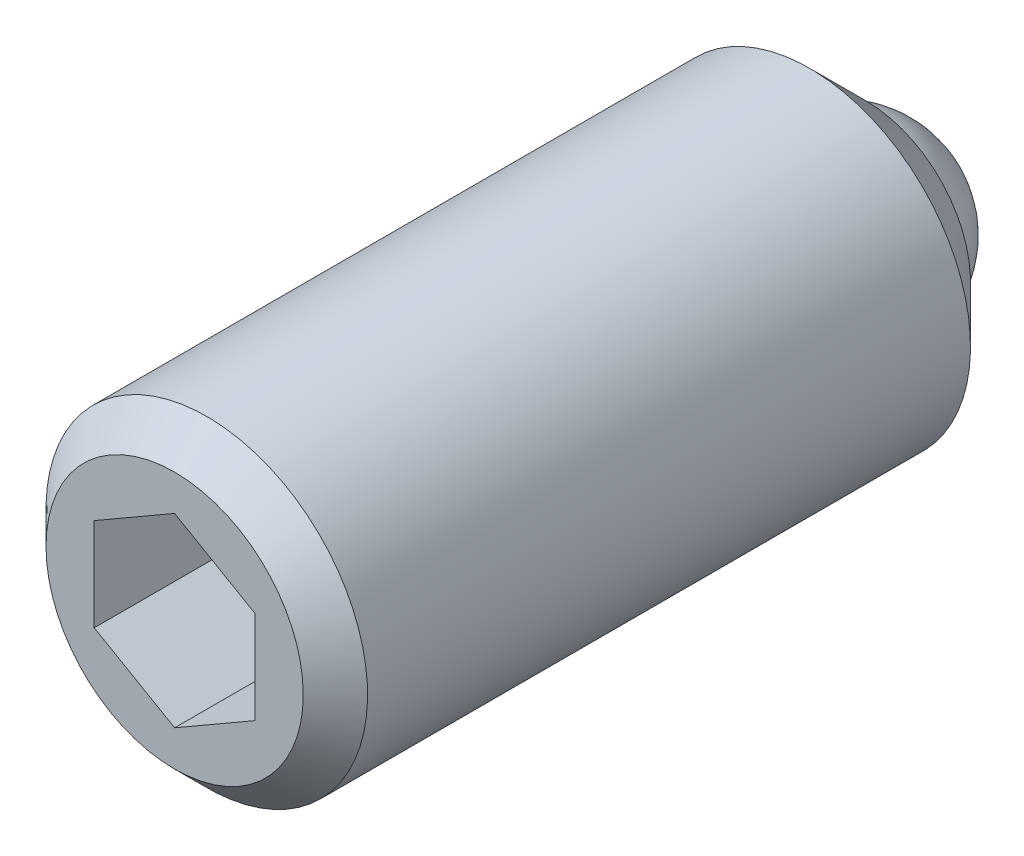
ISO-10303-21;
HEADER;
FILE_DESCRIPTION(('STEP AP214'),'2;1');
FILE_NAME('part.step','',(''),(''),'','','');
FILE_SCHEMA(('AUTOMOTIVE_DESIGN { 1 0 10303 214 1 1 1 1 }'));
ENDSEC;
DATA;
#1=APPLICATION_CONTEXT('core data for automotive mechanical design processes');
#2=APPLICATION_PROTOCOL_DEFINITION('international standard','automotive_design',2000,#1);
#3=PRODUCT_CONTEXT('',#1,'mechanical');
#4=PRODUCT('Part','Part','',(#3));
#5=PRODUCT_RELATED_PRODUCT_CATEGORY('part','',(#4));
#6=PRODUCT_DEFINITION_FORMATION('','',#4);
#7=PRODUCT_DEFINITION_CONTEXT('part definition',#1,'design');
#8=PRODUCT_DEFINITION('design','',#6,#7);
#9=PRODUCT_DEFINITION_SHAPE('','',#8);
#10=(LENGTH_UNIT() NAMED_UNIT(*) SI_UNIT(.MILLI.,.METRE.));
#11=(NAMED_UNIT(*) PLANE_ANGLE_UNIT() SI_UNIT($,.RADIAN.));
#12=(NAMED_UNIT(*) SI_UNIT($,.STERADIAN.) SOLID_ANGLE_UNIT());
#13=UNCERTAINTY_MEASURE_WITH_UNIT(LENGTH_MEASURE(1.E-05),#10,'distance_accuracy_value','');
#14=(GEOMETRIC_REPRESENTATION_CONTEXT(3) GLOBAL_UNCERTAINTY_ASSIGNED_CONTEXT((#13)) GLOBAL_UNIT_ASSIGNED_CONTEXT((#10,
#11,#12)) REPRESENTATION_CONTEXT('',''));
#15=CARTESIAN_POINT('',(0.,0.,0.));
#16=DIRECTION('',(0.,0.,1.));
#17=DIRECTION('',(1.,0.,0.));
#18=AXIS2_PLACEMENT_3D('',#15,#16,#17);
#19=CARTESIAN_POINT('',(-5.03895148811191E-08,-3.00000797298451E-08,6.));
#20=DIRECTION('',(2.62001557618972E-10,0.,1.));
#21=DIRECTION('',(-0.866025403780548,-0.500000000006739,2.26893360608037E-10));
#22=AXIS2_PLACEMENT_3D('',#19,#20,#21);
#23=SPHERICAL_SURFACE('',#22,6.);
#24=CARTESIAN_POINT('',(0.,0.,0.));
#25=VERTEX_POINT('',#24);
#26=VERTEX_LOOP('',#25);
#27=FACE_BOUND('',#26,.T.);
#28=CARTESIAN_POINT('',(-5.07825172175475E-08,-3.00000597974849E-08,4.5));
#29=DIRECTION('',(2.62001557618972E-10,0.,1.));
#30=DIRECTION('',(-0.500000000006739,0.866025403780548,1.31012286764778E-10));
#31=AXIS2_PLACEMENT_3D('',#28,#29,#30);
#32=CIRCLE('',#31,5.80947501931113);
#33=CARTESIAN_POINT('',(-2.90473756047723,5.03115291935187,4.50000000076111));
#34=VERTEX_POINT('',#33);
#35=EDGE_CURVE('E18',#34,#34,#32,.F.);
#36=ORIENTED_EDGE('',*,*,#35,.T.);
#37=EDGE_LOOP('',(#36));
#38=FACE_BOUND('',#37,.T.);
#39=ADVANCED_FACE('F14',(#27,#38),#23,.T.);
#40=CARTESIAN_POINT('',(2.55999995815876,7.25151935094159,39.4999999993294));
#41=DIRECTION('',(-2.62001557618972E-10,0.,-1.));
#42=DIRECTION('',(0.500000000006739,-0.866025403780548,-1.31012286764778E-10));
#43=AXIS2_PLACEMENT_3D('',#40,#41,#42);
#44=PLANE('',#43);
#45=DIRECTION('',(0.866025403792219,-0.499999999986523,-2.26906648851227E-10));
#46=VECTOR('',#45,1.);
#47=CARTESIAN_POINT('',(-2.50000004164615,-4.33012704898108,39.5000000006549));
#48=LINE('',#47,#46);
#49=CARTESIAN_POINT('',(-5.00000003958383,-2.88675137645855,39.50000000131));
#50=VERTEX_POINT('',#49);
#51=CARTESIAN_POINT('',(-4.09274229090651E-08,-5.77350272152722,39.5));
#52=VERTEX_POINT('',#51);
#53=EDGE_CURVE('E83',#50,#52,#48,.T.);
#54=ORIENTED_EDGE('',*,*,#53,.T.);
#55=DIRECTION('',(0.866025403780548,0.500000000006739,-2.26893360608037E-10));
#56=VECTOR('',#55,1.);
#57=CARTESIAN_POINT('',(2.49999995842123,-4.33012704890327,39.499999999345));
#58=LINE('',#57,#56);
#59=CARTESIAN_POINT('',(4.9999999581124,-2.88675137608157,39.49999999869));
#60=VERTEX_POINT('',#59);
#61=EDGE_CURVE('E77',#52,#60,#58,.T.);
#62=ORIENTED_EDGE('',*,*,#61,.T.);
#63=DIRECTION('',(0.,1.,0.));
#64=VECTOR('',#63,1.);
#65=CARTESIAN_POINT('',(4.99999995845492,-2.99227179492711E-08,39.49999999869));
#66=LINE('',#65,#64);
#67=CARTESIAN_POINT('',(4.99999995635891,2.8867513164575,39.4999999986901));
#68=VERTEX_POINT('',#67);
#69=EDGE_CURVE('E80',#60,#68,#66,.T.);
#70=ORIENTED_EDGE('',*,*,#69,.T.);
#71=DIRECTION('',(-0.866025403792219,0.499999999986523,2.26906648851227E-10));
#72=VECTOR('',#71,1.);
#73=CARTESIAN_POINT('',(2.49999995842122,4.33012698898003,39.4999999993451));
#74=LINE('',#73,#72);
#75=CARTESIAN_POINT('',(-4.19549837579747E-08,5.77350266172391,39.5));
#76=VERTEX_POINT('',#75);
#77=EDGE_CURVE('E95',#68,#76,#74,.T.);
#78=ORIENTED_EDGE('',*,*,#77,.T.);
#79=DIRECTION('',(-0.866025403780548,-0.500000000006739,2.26893360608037E-10));
#80=VECTOR('',#79,1.);
#81=CARTESIAN_POINT('',(-2.50000004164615,4.33012698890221,39.500000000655));
#82=LINE('',#81,#80);
#83=CARTESIAN_POINT('',(-5.00000004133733,2.88675131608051,39.50000000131));
#84=VERTEX_POINT('',#83);
#85=EDGE_CURVE('E101',#76,#84,#82,.T.);
#86=ORIENTED_EDGE('',*,*,#85,.T.);
#87=DIRECTION('',(0.,-1.,0.));
#88=VECTOR('',#87,1.);
#89=CARTESIAN_POINT('',(-5.00000004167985,-3.00783330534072E-08,39.50000000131));
#90=LINE('',#89,#88);
#91=EDGE_CURVE('E104',#84,#50,#90,.T.);
#92=ORIENTED_EDGE('',*,*,#91,.T.);
#93=EDGE_LOOP('',(#54,#62,#70,#78,#86,#92));
#94=FACE_BOUND('',#93,.T.);
#95=ADVANCED_FACE('F78',(#94),#44,.F.);
#96=CARTESIAN_POINT('',(9.00531727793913,-2.39639778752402,4.49999999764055));
#97=DIRECTION('',(2.62001557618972E-10,0.,1.));
#98=DIRECTION('',(-0.500000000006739,0.866025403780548,1.31012286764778E-10));
#99=AXIS2_PLACEMENT_3D('',#96,#97,#98);
#100=PLANE('',#99);
#101=ORIENTED_EDGE('',*,*,#35,.F.);
#102=EDGE_LOOP('',(#101));
#103=FACE_BOUND('',#102,.T.);
#104=CARTESIAN_POINT('',(-5.07825172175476E-08,-3.00000597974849E-08,4.5));
#105=DIRECTION('',(2.62002019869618E-10,0.,1.));
#106=DIRECTION('',(-0.866025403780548,-0.500000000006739,2.26893894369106E-10));
#107=AXIS2_PLACEMENT_3D('',#104,#105,#106);
#108=CIRCLE('',#107,6.5);
#109=CARTESIAN_POINT('',(-5.62916517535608,-3.25000003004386,4.50000000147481));
#110=VERTEX_POINT('',#109);
#111=EDGE_CURVE('E121',#110,#110,#108,.T.);
#112=ORIENTED_EDGE('',*,*,#111,.F.);
#113=EDGE_LOOP('',(#112));
#114=FACE_BOUND('',#113,.T.);
#115=ADVANCED_FACE('F134',(#103,#114),#100,.F.);
#116=CARTESIAN_POINT('',(4.99999996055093,-2.88675137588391,47.49999999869));
#117=DIRECTION('',(0.500000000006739,-0.866025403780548,-1.31012286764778E-10));
#118=DIRECTION('',(-0.866025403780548,-0.500000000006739,2.26893360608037E-10));
#119=AXIS2_PLACEMENT_3D('',#116,#117,#118);
#120=PLANE('',#119);
#121=DIRECTION('',(-2.62001557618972E-10,0.,-1.));
#122=VECTOR('',#121,1.);
#123=CARTESIAN_POINT('',(4.99999995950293,-2.88675137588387,43.49999999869));
#124=LINE('',#123,#122);
#125=CARTESIAN_POINT('',(4.99999996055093,-2.88675137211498,47.49999999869));
#126=VERTEX_POINT('',#125);
#127=EDGE_CURVE('E84',#126,#60,#124,.T.);
#128=ORIENTED_EDGE('',*,*,#127,.T.);
#129=ORIENTED_EDGE('',*,*,#61,.F.);
#130=DIRECTION('',(2.62001557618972E-10,0.,1.));
#131=VECTOR('',#130,1.);
#132=CARTESIAN_POINT('',(-4.05644541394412E-08,-5.77350272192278,43.5));
#133=LINE('',#132,#131);
#134=CARTESIAN_POINT('',(-4.27804501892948E-08,-5.77350272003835,47.5));
#135=VERTEX_POINT('',#134);
#136=EDGE_CURVE('E54',#52,#135,#133,.T.);
#137=ORIENTED_EDGE('',*,*,#136,.T.);
#138=DIRECTION('',(0.866025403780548,0.500000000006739,-2.26893360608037E-10));
#139=VECTOR('',#138,1.);
#140=CARTESIAN_POINT('',(2.49999995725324,-4.33012704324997,47.4999999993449));
#141=LINE('',#140,#139);
#142=EDGE_CURVE('E48',#135,#126,#141,.T.);
#143=ORIENTED_EDGE('',*,*,#142,.T.);
#144=EDGE_LOOP('',(#128,#129,#137,#143));
#145=FACE_BOUND('',#144,.T.);
#146=ADVANCED_FACE('F86',(#145),#120,.F.);
#147=CARTESIAN_POINT('',(4.99999996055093,2.88675131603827,47.49999999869));
#148=DIRECTION('',(1.,0.,-2.62001557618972E-10));
#149=DIRECTION('',(0.,-1.,0.));
#150=AXIS2_PLACEMENT_3D('',#147,#148,#149);
#151=PLANE('',#150);
#152=DIRECTION('',(-2.62001557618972E-10,0.,-1.));
#153=VECTOR('',#152,1.);
#154=CARTESIAN_POINT('',(4.99999995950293,2.88675131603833,43.4999999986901));
#155=LINE('',#154,#153);
#156=CARTESIAN_POINT('',(4.99999996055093,2.88675131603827,47.49999999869));
#157=VERTEX_POINT('',#156);
#158=EDGE_CURVE('E92',#157,#68,#155,.T.);
#159=ORIENTED_EDGE('',*,*,#158,.T.);
#160=ORIENTED_EDGE('',*,*,#69,.F.);
#161=ORIENTED_EDGE('',*,*,#127,.F.);
#162=DIRECTION('',(0.,-1.,0.));
#163=VECTOR('',#162,1.);
#164=CARTESIAN_POINT('',(4.99999996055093,2.88675131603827,47.49999999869));
#165=LINE('',#164,#163);
#166=EDGE_CURVE('E120',#126,#157,#165,.F.);
#167=ORIENTED_EDGE('',*,*,#166,.T.);
#168=EDGE_LOOP('',(#159,#160,#161,#167));
#169=FACE_BOUND('',#168,.T.);
#170=ADVANCED_FACE('F90',(#169),#151,.F.);
#171=CARTESIAN_POINT('',(-3.95164521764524E-08,5.77350266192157,47.5));
#172=DIRECTION('',(0.499999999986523,0.866025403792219,-1.30989270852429E-10));
#173=DIRECTION('',(0.866025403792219,-0.499999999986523,-2.26906648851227E-10));
#174=AXIS2_PLACEMENT_3D('',#171,#172,#173);
#175=PLANE('',#174);
#176=DIRECTION('',(-2.62001557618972E-10,0.,-1.));
#177=VECTOR('',#176,1.);
#178=CARTESIAN_POINT('',(-4.05644593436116E-08,5.77350266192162,43.5));
#179=LINE('',#178,#177);
#180=CARTESIAN_POINT('',(-3.62524532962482E-08,5.77350266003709,47.5));
#181=VERTEX_POINT('',#180);
#182=EDGE_CURVE('E100',#181,#76,#179,.T.);
#183=ORIENTED_EDGE('',*,*,#182,.T.);
#184=ORIENTED_EDGE('',*,*,#77,.F.);
#185=ORIENTED_EDGE('',*,*,#158,.F.);
#186=DIRECTION('',(0.866025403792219,-0.499999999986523,-2.26906648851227E-10));
#187=VECTOR('',#186,1.);
#188=CARTESIAN_POINT('',(-3.95164521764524E-08,5.77350266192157,47.5));
#189=LINE('',#188,#187);
#190=EDGE_CURVE('E114',#157,#181,#189,.F.);
#191=ORIENTED_EDGE('',*,*,#190,.T.);
#192=EDGE_LOOP('',(#183,#184,#185,#191));
#193=FACE_BOUND('',#192,.T.);
#194=ADVANCED_FACE('F200',(#193),#175,.F.);
#195=CARTESIAN_POINT('',(-5.00000003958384,2.88675131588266,47.5000000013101));
#196=DIRECTION('',(-0.500000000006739,0.866025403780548,1.31012286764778E-10));
#197=DIRECTION('',(0.866025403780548,0.500000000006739,-2.26893360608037E-10));
#198=AXIS2_PLACEMENT_3D('',#195,#196,#197);
#199=PLANE('',#198);
#200=DIRECTION('',(-2.62001557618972E-10,0.,-1.));
#201=VECTOR('',#200,1.);
#202=CARTESIAN_POINT('',(-5.00000004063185,2.88675131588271,43.50000000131));
#203=LINE('',#202,#201);
#204=CARTESIAN_POINT('',(-5.00000003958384,2.88675131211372,47.5000000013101));
#205=VERTEX_POINT('',#204);
#206=EDGE_CURVE('E103',#205,#84,#203,.T.);
#207=ORIENTED_EDGE('',*,*,#206,.T.);
#208=ORIENTED_EDGE('',*,*,#85,.F.);
#209=ORIENTED_EDGE('',*,*,#182,.F.);
#210=DIRECTION('',(-0.866025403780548,-0.500000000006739,2.26893360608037E-10));
#211=VECTOR('',#210,1.);
#212=CARTESIAN_POINT('',(-2.50000003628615,4.3301269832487,47.5000000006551));
#213=LINE('',#212,#211);
#214=EDGE_CURVE('E112',#181,#205,#213,.T.);
#215=ORIENTED_EDGE('',*,*,#214,.T.);
#216=EDGE_LOOP('',(#207,#208,#209,#215));
#217=FACE_BOUND('',#216,.T.);
#218=ADVANCED_FACE('F209',(#217),#199,.F.);
#219=CARTESIAN_POINT('',(-5.00000003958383,-2.88675137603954,47.50000000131));
#220=DIRECTION('',(-1.,0.,2.62001557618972E-10));
#221=DIRECTION('',(0.,1.,0.));
#222=AXIS2_PLACEMENT_3D('',#219,#220,#221);
#223=PLANE('',#222);
#224=DIRECTION('',(-2.62001557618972E-10,0.,-1.));
#225=VECTOR('',#224,1.);
#226=CARTESIAN_POINT('',(-5.00000004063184,-2.88675137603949,43.5000000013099));
#227=LINE('',#226,#225);
#228=CARTESIAN_POINT('',(-5.00000003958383,-2.88675137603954,47.50000000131));
#229=VERTEX_POINT('',#228);
#230=EDGE_CURVE('E106',#229,#50,#227,.T.);
#231=ORIENTED_EDGE('',*,*,#230,.T.);
#232=ORIENTED_EDGE('',*,*,#91,.F.);
#233=ORIENTED_EDGE('',*,*,#206,.F.);
#234=DIRECTION('',(0.,1.,0.));
#235=VECTOR('',#234,1.);
#236=CARTESIAN_POINT('',(-5.00000003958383,-2.88675137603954,47.50000000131));
#237=LINE('',#236,#235);
#238=EDGE_CURVE('E33',#205,#229,#237,.F.);
#239=ORIENTED_EDGE('',*,*,#238,.T.);
#240=EDGE_LOOP('',(#231,#232,#233,#239));
#241=FACE_BOUND('',#240,.T.);
#242=ADVANCED_FACE('F219',(#241),#223,.F.);
#243=CARTESIAN_POINT('',(-3.95164517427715E-08,-5.77350272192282,47.5));
#244=DIRECTION('',(-0.499999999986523,-0.866025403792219,1.30989270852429E-10));
#245=DIRECTION('',(-0.866025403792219,0.499999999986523,2.26906648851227E-10));
#246=AXIS2_PLACEMENT_3D('',#243,#244,#245);
#247=PLANE('',#246);
#248=ORIENTED_EDGE('',*,*,#136,.F.);
#249=ORIENTED_EDGE('',*,*,#53,.F.);
#250=ORIENTED_EDGE('',*,*,#230,.F.);
#251=DIRECTION('',(-0.866025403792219,0.499999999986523,2.26906648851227E-10));
#252=VECTOR('',#251,1.);
#253=CARTESIAN_POINT('',(-3.95164517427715E-08,-5.77350272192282,47.5));
#254=LINE('',#253,#252);
#255=EDGE_CURVE('E110',#229,#135,#254,.F.);
#256=ORIENTED_EDGE('',*,*,#255,.T.);
#257=EDGE_LOOP('',(#248,#249,#250,#256));
#258=FACE_BOUND('',#257,.T.);
#259=ADVANCED_FACE('F160',(#258),#247,.F.);
#260=CARTESIAN_POINT('',(-5.07825172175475E-08,-3.00000597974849E-08,4.5));
#261=DIRECTION('',(2.62002019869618E-10,0.,1.));
#262=DIRECTION('',(-0.866025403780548,-0.500000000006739,2.26893894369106E-10));
#263=AXIS2_PLACEMENT_3D('',#260,#261,#262);
#264=CONICAL_SURFACE('',#263,6.5,0.785398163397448);
#265=CARTESIAN_POINT('',(-4.98655117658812E-08,-3.00001063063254E-08,8.));
#266=DIRECTION('',(2.62001557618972E-10,0.,1.));
#267=DIRECTION('',(-0.500000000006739,0.866025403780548,1.31012286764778E-10));
#268=AXIS2_PLACEMENT_3D('',#265,#266,#267);
#269=CIRCLE('',#268,10.);
#270=CARTESIAN_POINT('',(-5.0000000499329,8.66025400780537,8.00000000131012));
#271=VERTEX_POINT('',#270);
#272=EDGE_CURVE('E108',#271,#271,#269,.T.);
#273=ORIENTED_EDGE('',*,*,#272,.F.);
#274=EDGE_LOOP('',(#273));
#275=FACE_BOUND('',#274,.T.);
#276=ORIENTED_EDGE('',*,*,#111,.T.);
#277=EDGE_LOOP('',(#276));
#278=FACE_BOUND('',#277,.T.);
#279=ADVANCED_FACE('F132',(#275,#278),#264,.T.);
#280=CARTESIAN_POINT('',(2.98746744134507,11.0732706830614,47.4999999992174));
#281=DIRECTION('',(-2.62001557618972E-10,0.,-1.));
#282=DIRECTION('',(0.500000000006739,-0.866025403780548,-1.31012286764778E-10));
#283=AXIS2_PLACEMENT_3D('',#280,#281,#282);
#284=PLANE('',#283);
#285=ORIENTED_EDGE('',*,*,#238,.F.);
#286=ORIENTED_EDGE('',*,*,#214,.F.);
#287=ORIENTED_EDGE('',*,*,#190,.F.);
#288=ORIENTED_EDGE('',*,*,#166,.F.);
#289=ORIENTED_EDGE('',*,*,#142,.F.);
#290=ORIENTED_EDGE('',*,*,#255,.F.);
#291=EDGE_LOOP('',(#285,#286,#287,#288,#289,#290));
#292=FACE_BOUND('',#291,.T.);
#293=CARTESIAN_POINT('',(-3.95164502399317E-08,-3.00006311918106E-08,47.5));
#294=DIRECTION('',(-2.62001557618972E-10,0.,-1.));
#295=DIRECTION('',(0.500000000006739,-0.866025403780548,-1.31012286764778E-10));
#296=AXIS2_PLACEMENT_3D('',#293,#294,#295);
#297=CIRCLE('',#296,8.);
#298=CARTESIAN_POINT('',(3.99999996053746,-6.92820326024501,47.4999999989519));
#299=VERTEX_POINT('',#298);
#300=EDGE_CURVE('E24',#299,#299,#297,.T.);
#301=ORIENTED_EDGE('',*,*,#300,.F.);
#302=EDGE_LOOP('',(#301));
#303=FACE_BOUND('',#302,.T.);
#304=ADVANCED_FACE('F16',(#292,#303),#284,.F.);
#305=CARTESIAN_POINT('',(-4.98655117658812E-08,-3.00001063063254E-08,8.));
#306=DIRECTION('',(2.62001557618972E-10,0.,1.));
#307=DIRECTION('',(-0.500000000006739,0.866025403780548,1.31012286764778E-10));
#308=AXIS2_PLACEMENT_3D('',#305,#306,#307);
#309=CYLINDRICAL_SURFACE('',#308,10.);
#310=CARTESIAN_POINT('',(-4.00404533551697E-08,-3.00006046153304E-08,45.5));
#311=DIRECTION('',(-2.62001557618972E-10,0.,-1.));
#312=DIRECTION('',(0.500000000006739,-0.866025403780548,-1.3101211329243E-10));
#313=AXIS2_PLACEMENT_3D('',#310,#311,#312);
#314=CIRCLE('',#313,10.);
#315=CARTESIAN_POINT('',(4.99999996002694,-8.66025406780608,45.4999999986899));
#316=VERTEX_POINT('',#315);
#317=EDGE_CURVE('E9',#316,#316,#314,.F.);
#318=ORIENTED_EDGE('',*,*,#317,.F.);
#319=EDGE_LOOP('',(#318));
#320=FACE_BOUND('',#319,.T.);
#321=ORIENTED_EDGE('',*,*,#272,.T.);
#322=EDGE_LOOP('',(#321));
#323=FACE_BOUND('',#322,.T.);
#324=ADVANCED_FACE('F148',(#320,#323),#309,.T.);
#325=CARTESIAN_POINT('',(-3.95164502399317E-08,-3.00006311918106E-08,47.5));
#326=DIRECTION('',(-2.62001557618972E-10,0.,-1.));
#327=DIRECTION('',(0.500000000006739,-0.866025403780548,-1.31012286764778E-10));
#328=AXIS2_PLACEMENT_3D('',#325,#326,#327);
#329=CONICAL_SURFACE('',#328,8.,0.785398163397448);
#330=ORIENTED_EDGE('',*,*,#317,.T.);
#331=EDGE_LOOP('',(#330));
#332=FACE_BOUND('',#331,.T.);
#333=ORIENTED_EDGE('',*,*,#300,.T.);
#334=EDGE_LOOP('',(#333));
#335=FACE_BOUND('',#334,.T.);
#336=ADVANCED_FACE('F146',(#332,#335),#329,.T.);
#337=CLOSED_SHELL('',(#39,#95,#115,#146,#170,#194,#218,#242,#259,#279,#304,#324,#336));
#338=MANIFOLD_SOLID_BREP('B1',#337);
#339=ADVANCED_BREP_SHAPE_REPRESENTATION('',(#18,#338),#14);
#340=SHAPE_DEFINITION_REPRESENTATION(#9,#339);
ENDSEC;
END-ISO-10303-21;
